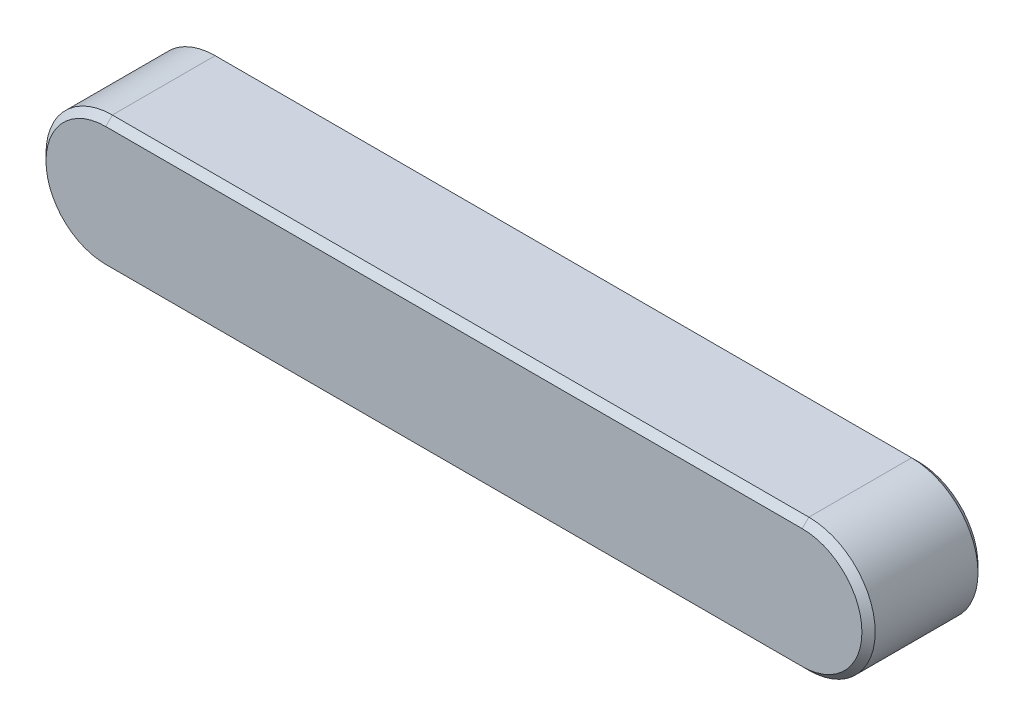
from build123d import *

# Parameters (mm, degrees)
EXTRUDE1_DEPTH = 7
CHAMFER1_SIZE  = 0.4


with BuildPart() as part:
    # body → Extrude1 (new body)
    with BuildSketch(Plane.XY):
        with BuildLine():
            ThreePointArc((42, 0), (46, 4), (42, 8))
            Line((42, 8), (0, 8))
            ThreePointArc((0, 8), (-4, 4), (0, 0))
            Line((0, 0), (42, 0))
        make_face()
    extrude(amount=EXTRUDE1_DEPTH)

    # Chamfer1
    chamfer1_edges = [part.edges().sort_by_distance(p)[0] for p in [
        (21, 0, 7),
        (46, 4, 7),
        (21, 8, 7),
        (46, 4, 0),
        (21, 0, 0),
        (-4, 4, 0),
        (21, 8, 0),
        (-4, 4, 7),
    ]]
    chamfer(chamfer1_edges, length=CHAMFER1_SIZE)


solid = part.part
